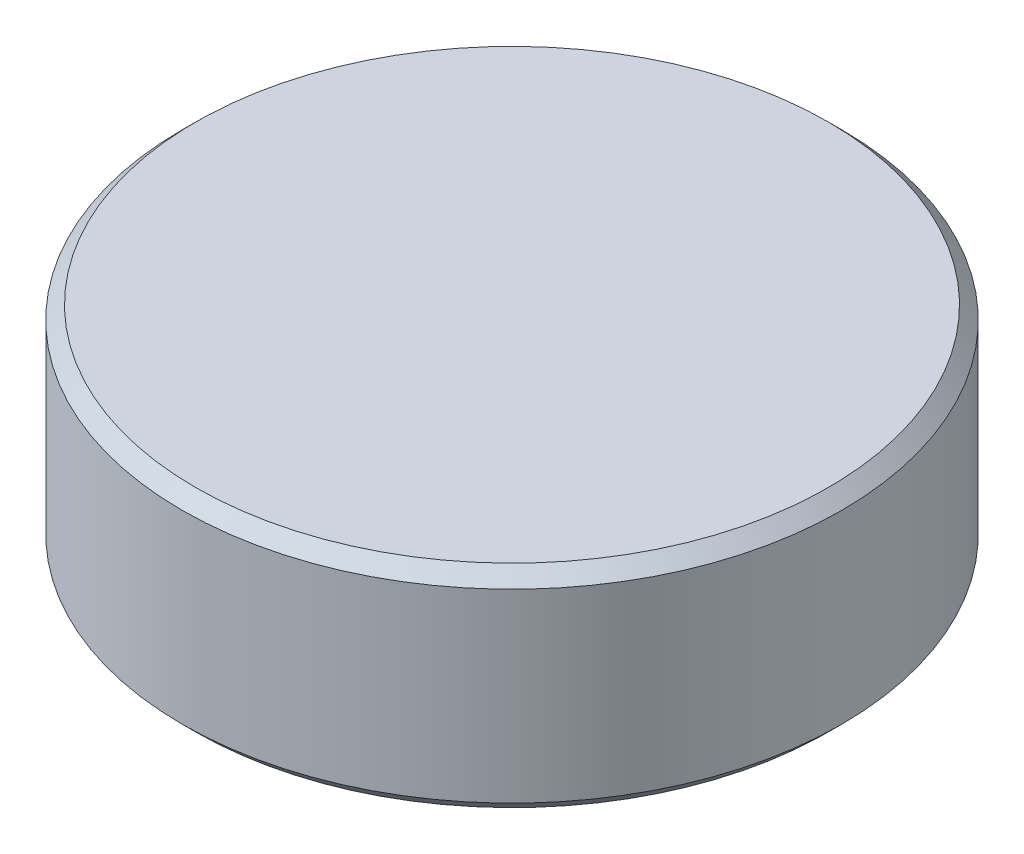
from build123d import *
from build123d.topology import SkipClean

# Parameters (mm, degrees)
SKETCH1_R           = 7.475
BOSS_EXTRUDE1_DEPTH = 4
SKETCH2_R           = 12.15
SKETCH2_R_2         = 10.15
BOSS_EXTRUDE2_DEPTH = 4
SKETCH3_R           = 12.2
BOSS_EXTRUDE3_DEPTH = 0.8
SKETCH4_R           = 15.763313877
SKETCH4_R_2         = 7.475
CUT_EXTRUDE1_DEPTH  = 18.908657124
SKETCH5_R           = 1.5
BOSS_EXTRUDE4_DEPTH = 1
CHAMFER1_SIZE       = 0.3


with BuildPart() as part:
    # Sketch1 → Boss-Extrude1 (new body)
    with BuildSketch(Plane(origin=(0, 0, 0), x_dir=(1, 0, 0), z_dir=(0, 1, 0))):
        with Locations(Location((0, 0, 0), (0, 0, 270))):
            Circle(SKETCH1_R)
    extrude(amount=BOSS_EXTRUDE1_DEPTH)



with BuildPart() as body_2:
    # Sketch2 → Boss-Extrude2 (new body)
    with BuildSketch(Plane(origin=(0, 0, 0), x_dir=(1, 0, 0), z_dir=(0, 1, 0))):
        with Locations(Location((0, 0, 0), (0, 0, 270))):
            Circle(SKETCH2_R)
        with Locations(Location((0, 0, 0), (0, 0, 270))):
            Circle(SKETCH2_R_2, mode=Mode.SUBTRACT)
    extrude(amount=BOSS_EXTRUDE2_DEPTH)


with BuildPart() as part_1:
    add(part.part)

    add(body_2.part)  # Boss-Extrude3 merges body 2
    # Sketch3 → Boss-Extrude3 (add)
    with BuildSketch(Plane(origin=(0, 4, 0), x_dir=(1, 0, 0), z_dir=(0, 1, 0))):
        with Locations(Location((0, 0, 0), (0, 0, 270))):
            Circle(SKETCH3_R)
    extrude(amount=BOSS_EXTRUDE3_DEPTH)

    # Sketch4 → Cut-Extrude1 (cut, through all)
    with SkipClean():  # the faces are left unmerged after this step: merging them gives an invalid solid
        with BuildSketch(Plane.XZ):
            Circle(SKETCH4_R)
            with Locations(Location((0, 0, 0), (0, 0, 270))):
                Circle(SKETCH4_R_2, mode=Mode.SUBTRACT)
        extrude(amount=-CUT_EXTRUDE1_DEPTH, mode=Mode.SUBTRACT)

    # Sketch5 → Boss-Extrude4 (add)
    with SkipClean():  # the faces are left unmerged after this step: merging them gives an invalid solid
        with BuildSketch(Plane.XZ):
            with Locations(Location((0, 0, 0), (0, 0, 270))):
                Circle(SKETCH5_R)
        extrude(amount=BOSS_EXTRUDE4_DEPTH)

    # Chamfer1
    chamfer1_edges = [part_1.edges().sort_by_distance(p)[0] for p in [
        (0, 4.8, 7.475),
        (7.475, 0, 0),
    ]]
    chamfer(chamfer1_edges, length=CHAMFER1_SIZE)


solid = part_1.part
